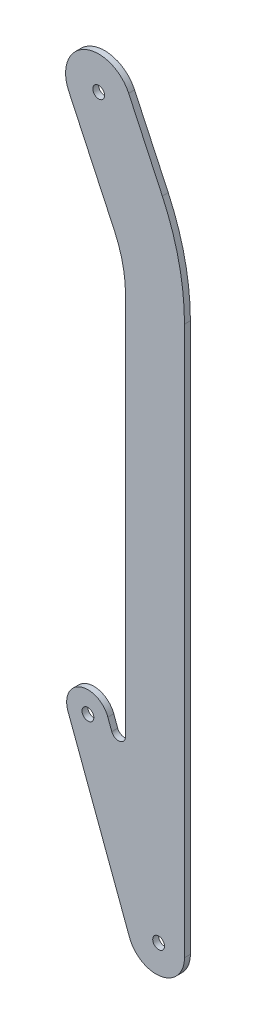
ISO-10303-21;
HEADER;
FILE_DESCRIPTION(('STEP AP214'),'2;1');
FILE_NAME('part.step','',(''),(''),'','','');
FILE_SCHEMA(('AUTOMOTIVE_DESIGN { 1 0 10303 214 1 1 1 1 }'));
ENDSEC;
DATA;
#1=APPLICATION_CONTEXT('core data for automotive mechanical design processes');
#2=APPLICATION_PROTOCOL_DEFINITION('international standard','automotive_design',2000,#1);
#3=PRODUCT_CONTEXT('',#1,'mechanical');
#4=PRODUCT('Part','Part','',(#3));
#5=PRODUCT_RELATED_PRODUCT_CATEGORY('part','',(#4));
#6=PRODUCT_DEFINITION_FORMATION('','',#4);
#7=PRODUCT_DEFINITION_CONTEXT('part definition',#1,'design');
#8=PRODUCT_DEFINITION('design','',#6,#7);
#9=PRODUCT_DEFINITION_SHAPE('','',#8);
#10=(LENGTH_UNIT() NAMED_UNIT(*) SI_UNIT(.MILLI.,.METRE.));
#11=(NAMED_UNIT(*) PLANE_ANGLE_UNIT() SI_UNIT($,.RADIAN.));
#12=(NAMED_UNIT(*) SI_UNIT($,.STERADIAN.) SOLID_ANGLE_UNIT());
#13=UNCERTAINTY_MEASURE_WITH_UNIT(LENGTH_MEASURE(1.E-05),#10,'distance_accuracy_value','');
#14=(GEOMETRIC_REPRESENTATION_CONTEXT(3) GLOBAL_UNCERTAINTY_ASSIGNED_CONTEXT((#13)) GLOBAL_UNIT_ASSIGNED_CONTEXT((#10,
#11,#12)) REPRESENTATION_CONTEXT('',''));
#15=CARTESIAN_POINT('',(0.,0.,0.));
#16=DIRECTION('',(0.,0.,1.));
#17=DIRECTION('',(1.,0.,0.));
#18=AXIS2_PLACEMENT_3D('',#15,#16,#17);
#19=CARTESIAN_POINT('',(-25.3570957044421,298.926441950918,-2.5));
#20=DIRECTION('',(0.,0.,1.));
#21=DIRECTION('',(1.,0.,0.));
#22=AXIS2_PLACEMENT_3D('',#19,#20,#21);
#23=CYLINDRICAL_SURFACE('',#22,14.);
#24=CARTESIAN_POINT('',(-25.3570957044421,298.926441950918,0.));
#25=DIRECTION('',(0.,0.,1.));
#26=DIRECTION('',(1.,0.,0.));
#27=AXIS2_PLACEMENT_3D('',#24,#25,#26);
#28=CIRCLE('',#27,14.);
#29=CARTESIAN_POINT('',(-12.668786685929,304.843097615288,0.));
#30=VERTEX_POINT('',#29);
#31=CARTESIAN_POINT('',(-38.0454047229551,293.009786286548,0.));
#32=VERTEX_POINT('',#31);
#33=EDGE_CURVE('E158',#30,#32,#28,.T.);
#34=ORIENTED_EDGE('',*,*,#33,.F.);
#35=DIRECTION('',(0.,0.,1.));
#36=VECTOR('',#35,1.);
#37=CARTESIAN_POINT('',(-12.668786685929,304.843097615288,-2.5));
#38=LINE('',#37,#36);
#39=CARTESIAN_POINT('',(-12.668786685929,304.843097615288,-2.5));
#40=VERTEX_POINT('',#39);
#41=EDGE_CURVE('E11',#40,#30,#38,.T.);
#42=ORIENTED_EDGE('',*,*,#41,.F.);
#43=CARTESIAN_POINT('',(-25.3570957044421,298.926441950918,-2.5));
#44=DIRECTION('',(0.,0.,1.));
#45=DIRECTION('',(1.,0.,0.));
#46=AXIS2_PLACEMENT_3D('',#43,#44,#45);
#47=CIRCLE('',#46,14.);
#48=CARTESIAN_POINT('',(-38.0454047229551,293.009786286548,-2.5));
#49=VERTEX_POINT('',#48);
#50=EDGE_CURVE('E191',#40,#49,#47,.T.);
#51=ORIENTED_EDGE('',*,*,#50,.T.);
#52=DIRECTION('',(0.,0.,1.));
#53=VECTOR('',#52,1.);
#54=CARTESIAN_POINT('',(-38.0454047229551,293.009786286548,-2.5));
#55=LINE('',#54,#53);
#56=EDGE_CURVE('E40',#49,#32,#55,.T.);
#57=ORIENTED_EDGE('',*,*,#56,.T.);
#58=EDGE_LOOP('',(#34,#42,#51,#57));
#59=FACE_BOUND('',#58,.T.);
#60=ADVANCED_FACE('F37',(#59),#23,.T.);
#61=CARTESIAN_POINT('',(-12.668786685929,304.843097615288,-2.5));
#62=DIRECTION('',(0.90630778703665,0.4226182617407,0.));
#63=DIRECTION('',(-0.4226182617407,0.90630778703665,0.));
#64=AXIS2_PLACEMENT_3D('',#61,#62,#63);
#65=PLANE('',#64);
#66=DIRECTION('',(-0.4226182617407,0.90630778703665,0.));
#67=VECTOR('',#66,1.);
#68=CARTESIAN_POINT('',(-12.668786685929,304.843097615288,0.));
#69=LINE('',#68,#67);
#70=CARTESIAN_POINT('',(1.56356733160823,274.321715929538,0.));
#71=VERTEX_POINT('',#70);
#72=EDGE_CURVE('E189',#71,#30,#69,.T.);
#73=ORIENTED_EDGE('',*,*,#72,.F.);
#74=DIRECTION('',(0.,0.,1.));
#75=VECTOR('',#74,1.);
#76=CARTESIAN_POINT('',(1.56356733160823,274.321715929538,-2.5));
#77=LINE('',#76,#75);
#78=CARTESIAN_POINT('',(1.56356733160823,274.321715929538,-2.5));
#79=VERTEX_POINT('',#78);
#80=EDGE_CURVE('E46',#79,#71,#77,.T.);
#81=ORIENTED_EDGE('',*,*,#80,.F.);
#82=DIRECTION('',(-0.4226182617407,0.90630778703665,0.));
#83=VECTOR('',#82,1.);
#84=CARTESIAN_POINT('',(-12.668786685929,304.843097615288,-2.5));
#85=LINE('',#84,#83);
#86=EDGE_CURVE('E148',#79,#40,#85,.T.);
#87=ORIENTED_EDGE('',*,*,#86,.T.);
#88=ORIENTED_EDGE('',*,*,#41,.T.);
#89=EDGE_LOOP('',(#73,#81,#87,#88));
#90=FACE_BOUND('',#89,.T.);
#91=ADVANCED_FACE('F211',(#90),#65,.T.);
#92=CARTESIAN_POINT('',(-89.0672113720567,232.059889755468,-2.5));
#93=DIRECTION('',(0.,0.,1.));
#94=DIRECTION('',(1.,0.,0.));
#95=AXIS2_PLACEMENT_3D('',#92,#93,#94);
#96=CYLINDRICAL_SURFACE('',#95,100.);
#97=CARTESIAN_POINT('',(-89.0672113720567,232.059889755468,0.));
#98=DIRECTION('',(0.,0.,1.));
#99=DIRECTION('',(1.,0.,0.));
#100=AXIS2_PLACEMENT_3D('',#97,#98,#99);
#101=CIRCLE('',#100,100.);
#102=CARTESIAN_POINT('',(10.9327886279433,232.059889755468,0.));
#103=VERTEX_POINT('',#102);
#104=EDGE_CURVE('E135',#103,#71,#101,.T.);
#105=ORIENTED_EDGE('',*,*,#104,.F.);
#106=DIRECTION('',(0.,0.,1.));
#107=VECTOR('',#106,1.);
#108=CARTESIAN_POINT('',(10.9327886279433,232.059889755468,-2.5));
#109=LINE('',#108,#107);
#110=CARTESIAN_POINT('',(10.9327886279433,232.059889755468,-2.5));
#111=VERTEX_POINT('',#110);
#112=EDGE_CURVE('E130',#111,#103,#109,.T.);
#113=ORIENTED_EDGE('',*,*,#112,.F.);
#114=CARTESIAN_POINT('',(-89.0672113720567,232.059889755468,-2.5));
#115=DIRECTION('',(0.,0.,1.));
#116=DIRECTION('',(1.,0.,0.));
#117=AXIS2_PLACEMENT_3D('',#114,#115,#116);
#118=CIRCLE('',#117,100.);
#119=EDGE_CURVE('E133',#111,#79,#118,.T.);
#120=ORIENTED_EDGE('',*,*,#119,.T.);
#121=ORIENTED_EDGE('',*,*,#80,.T.);
#122=EDGE_LOOP('',(#105,#113,#120,#121));
#123=FACE_BOUND('',#122,.T.);
#124=ADVANCED_FACE('F132',(#123),#96,.T.);
#125=CARTESIAN_POINT('',(10.9327886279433,0.,-2.5));
#126=DIRECTION('',(1.,0.,0.));
#127=DIRECTION('',(0.,1.,0.));
#128=AXIS2_PLACEMENT_3D('',#125,#126,#127);
#129=PLANE('',#128);
#130=DIRECTION('',(0.,1.,0.));
#131=VECTOR('',#130,1.);
#132=CARTESIAN_POINT('',(10.9327886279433,0.,0.));
#133=LINE('',#132,#131);
#134=CARTESIAN_POINT('',(10.9327886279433,0.,0.));
#135=VERTEX_POINT('',#134);
#136=EDGE_CURVE('E186',#135,#103,#133,.T.);
#137=ORIENTED_EDGE('',*,*,#136,.F.);
#138=DIRECTION('',(0.,0.,1.));
#139=VECTOR('',#138,1.);
#140=CARTESIAN_POINT('',(10.9327886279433,0.,-2.5));
#141=LINE('',#140,#139);
#142=CARTESIAN_POINT('',(10.9327886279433,0.,-2.5));
#143=VERTEX_POINT('',#142);
#144=EDGE_CURVE('E140',#143,#135,#141,.T.);
#145=ORIENTED_EDGE('',*,*,#144,.F.);
#146=DIRECTION('',(0.,1.,0.));
#147=VECTOR('',#146,1.);
#148=CARTESIAN_POINT('',(10.9327886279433,0.,-2.5));
#149=LINE('',#148,#147);
#150=EDGE_CURVE('E146',#143,#111,#149,.T.);
#151=ORIENTED_EDGE('',*,*,#150,.T.);
#152=ORIENTED_EDGE('',*,*,#112,.T.);
#153=EDGE_LOOP('',(#137,#145,#151,#152));
#154=FACE_BOUND('',#153,.T.);
#155=ADVANCED_FACE('F150',(#154),#129,.T.);
#156=CARTESIAN_POINT('',(-1.06721137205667,0.,-2.5));
#157=DIRECTION('',(0.,0.,1.));
#158=DIRECTION('',(1.,0.,0.));
#159=AXIS2_PLACEMENT_3D('',#156,#157,#158);
#160=CYLINDRICAL_SURFACE('',#159,12.);
#161=CARTESIAN_POINT('',(-1.06721137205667,0.,0.));
#162=DIRECTION('',(0.,0.,1.));
#163=DIRECTION('',(1.,0.,0.));
#164=AXIS2_PLACEMENT_3D('',#161,#162,#163);
#165=CIRCLE('',#164,12.);
#166=CARTESIAN_POINT('',(-12.3114693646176,-4.19126021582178,0.));
#167=VERTEX_POINT('',#166);
#168=EDGE_CURVE('E183',#167,#135,#165,.T.);
#169=ORIENTED_EDGE('',*,*,#168,.F.);
#170=DIRECTION('',(0.,0.,1.));
#171=VECTOR('',#170,1.);
#172=CARTESIAN_POINT('',(-12.3114693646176,-4.19126021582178,-2.5));
#173=LINE('',#172,#171);
#174=CARTESIAN_POINT('',(-12.3114693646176,-4.19126021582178,-2.5));
#175=VERTEX_POINT('',#174);
#176=EDGE_CURVE('E195',#175,#167,#173,.T.);
#177=ORIENTED_EDGE('',*,*,#176,.F.);
#178=CARTESIAN_POINT('',(-1.06721137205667,0.,-2.5));
#179=DIRECTION('',(0.,0.,1.));
#180=DIRECTION('',(1.,0.,0.));
#181=AXIS2_PLACEMENT_3D('',#178,#179,#180);
#182=CIRCLE('',#181,12.);
#183=EDGE_CURVE('E151',#175,#143,#182,.T.);
#184=ORIENTED_EDGE('',*,*,#183,.T.);
#185=ORIENTED_EDGE('',*,*,#144,.T.);
#186=EDGE_LOOP('',(#169,#177,#184,#185));
#187=FACE_BOUND('',#186,.T.);
#188=ADVANCED_FACE('F224',(#187),#160,.T.);
#189=CARTESIAN_POINT('',(-38.3393736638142,65.6360604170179,-2.5));
#190=DIRECTION('',(-0.937021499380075,-0.349271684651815,0.));
#191=DIRECTION('',(0.349271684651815,-0.937021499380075,0.));
#192=AXIS2_PLACEMENT_3D('',#189,#190,#191);
#193=PLANE('',#192);
#194=DIRECTION('',(0.349271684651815,-0.937021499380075,0.));
#195=VECTOR('',#194,1.);
#196=CARTESIAN_POINT('',(-38.3393736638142,65.6360604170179,0.));
#197=LINE('',#196,#195);
#198=CARTESIAN_POINT('',(-38.3393736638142,65.6360604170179,0.));
#199=VERTEX_POINT('',#198);
#200=EDGE_CURVE('E180',#199,#167,#197,.T.);
#201=ORIENTED_EDGE('',*,*,#200,.F.);
#202=DIRECTION('',(0.,0.,1.));
#203=VECTOR('',#202,1.);
#204=CARTESIAN_POINT('',(-38.3393736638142,65.6360604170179,-2.5));
#205=LINE('',#204,#203);
#206=CARTESIAN_POINT('',(-38.3393736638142,65.6360604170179,-2.5));
#207=VERTEX_POINT('',#206);
#208=EDGE_CURVE('E197',#207,#199,#205,.T.);
#209=ORIENTED_EDGE('',*,*,#208,.F.);
#210=DIRECTION('',(0.349271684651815,-0.937021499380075,0.));
#211=VECTOR('',#210,1.);
#212=CARTESIAN_POINT('',(-38.3393736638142,65.6360604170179,-2.5));
#213=LINE('',#212,#211);
#214=EDGE_CURVE('E153',#207,#175,#213,.T.);
#215=ORIENTED_EDGE('',*,*,#214,.T.);
#216=ORIENTED_EDGE('',*,*,#176,.T.);
#217=EDGE_LOOP('',(#201,#209,#215,#216));
#218=FACE_BOUND('',#217,.T.);
#219=ADVANCED_FACE('F227',(#218),#193,.T.);
#220=CARTESIAN_POINT('',(-29.9061801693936,68.7795055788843,-2.5));
#221=DIRECTION('',(0.,0.,1.));
#222=DIRECTION('',(1.,0.,0.));
#223=AXIS2_PLACEMENT_3D('',#220,#221,#222);
#224=CYLINDRICAL_SURFACE('',#223,9.);
#225=CARTESIAN_POINT('',(-29.9061801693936,68.7795055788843,0.));
#226=DIRECTION('',(0.,0.,1.));
#227=DIRECTION('',(1.,0.,0.));
#228=AXIS2_PLACEMENT_3D('',#225,#226,#227);
#229=CIRCLE('',#228,9.);
#230=CARTESIAN_POINT('',(-21.4729866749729,71.9229507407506,0.));
#231=VERTEX_POINT('',#230);
#232=EDGE_CURVE('E177',#231,#199,#229,.T.);
#233=ORIENTED_EDGE('',*,*,#232,.F.);
#234=DIRECTION('',(0.,0.,1.));
#235=VECTOR('',#234,1.);
#236=CARTESIAN_POINT('',(-21.4729866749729,71.9229507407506,-2.5));
#237=LINE('',#236,#235);
#238=CARTESIAN_POINT('',(-21.4729866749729,71.9229507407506,-2.5));
#239=VERTEX_POINT('',#238);
#240=EDGE_CURVE('E199',#239,#231,#237,.T.);
#241=ORIENTED_EDGE('',*,*,#240,.F.);
#242=CARTESIAN_POINT('',(-29.9061801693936,68.7795055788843,-2.5));
#243=DIRECTION('',(0.,0.,1.));
#244=DIRECTION('',(1.,0.,0.));
#245=AXIS2_PLACEMENT_3D('',#242,#243,#244);
#246=CIRCLE('',#245,9.);
#247=EDGE_CURVE('E311',#239,#207,#246,.T.);
#248=ORIENTED_EDGE('',*,*,#247,.T.);
#249=ORIENTED_EDGE('',*,*,#208,.T.);
#250=EDGE_LOOP('',(#233,#241,#248,#249));
#251=FACE_BOUND('',#250,.T.);
#252=ADVANCED_FACE('F231',(#251),#224,.T.);
#253=CARTESIAN_POINT('',(-21.4729866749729,71.9229507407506,-2.5));
#254=DIRECTION('',(0.937021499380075,0.349271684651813,0.));
#255=DIRECTION('',(-0.349271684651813,0.937021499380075,0.));
#256=AXIS2_PLACEMENT_3D('',#253,#254,#255);
#257=PLANE('',#256);
#258=DIRECTION('',(-0.349271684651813,0.937021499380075,0.));
#259=VECTOR('',#258,1.);
#260=CARTESIAN_POINT('',(-21.4729866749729,71.9229507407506,0.));
#261=LINE('',#260,#259);
#262=CARTESIAN_POINT('',(-19.8110644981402,67.4643676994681,0.));
#263=VERTEX_POINT('',#262);
#264=EDGE_CURVE('E174',#263,#231,#261,.T.);
#265=ORIENTED_EDGE('',*,*,#264,.F.);
#266=DIRECTION('',(0.,0.,1.));
#267=VECTOR('',#266,1.);
#268=CARTESIAN_POINT('',(-19.8110644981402,67.4643676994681,-2.5));
#269=LINE('',#268,#267);
#270=CARTESIAN_POINT('',(-19.8110644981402,67.4643676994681,-2.5));
#271=VERTEX_POINT('',#270);
#272=EDGE_CURVE('E201',#271,#263,#269,.T.);
#273=ORIENTED_EDGE('',*,*,#272,.F.);
#274=DIRECTION('',(-0.349271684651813,0.937021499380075,0.));
#275=VECTOR('',#274,1.);
#276=CARTESIAN_POINT('',(-21.4729866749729,71.9229507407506,-2.5));
#277=LINE('',#276,#275);
#278=EDGE_CURVE('E308',#271,#239,#277,.T.);
#279=ORIENTED_EDGE('',*,*,#278,.T.);
#280=ORIENTED_EDGE('',*,*,#240,.T.);
#281=EDGE_LOOP('',(#265,#273,#279,#280));
#282=FACE_BOUND('',#281,.T.);
#283=ADVANCED_FACE('F235',(#282),#257,.T.);
#284=CARTESIAN_POINT('',(-17.,68.5121827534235,-2.5));
#285=DIRECTION('',(0.,0.,1.));
#286=DIRECTION('',(1.,0.,0.));
#287=AXIS2_PLACEMENT_3D('',#284,#285,#286);
#288=CYLINDRICAL_SURFACE('',#287,3.);
#289=CARTESIAN_POINT('',(-17.,68.5121827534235,0.));
#290=DIRECTION('',(0.,0.,-1.));
#291=DIRECTION('',(1.,0.,0.));
#292=AXIS2_PLACEMENT_3D('',#289,#290,#291);
#293=CIRCLE('',#292,3.);
#294=CARTESIAN_POINT('',(-14.,68.5121827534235,0.));
#295=VERTEX_POINT('',#294);
#296=EDGE_CURVE('E171',#295,#263,#293,.T.);
#297=ORIENTED_EDGE('',*,*,#296,.F.);
#298=DIRECTION('',(0.,0.,1.));
#299=VECTOR('',#298,1.);
#300=CARTESIAN_POINT('',(-14.,68.5121827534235,-2.5));
#301=LINE('',#300,#299);
#302=CARTESIAN_POINT('',(-14.,68.5121827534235,-2.5));
#303=VERTEX_POINT('',#302);
#304=EDGE_CURVE('E203',#303,#295,#301,.T.);
#305=ORIENTED_EDGE('',*,*,#304,.F.);
#306=CARTESIAN_POINT('',(-17.,68.5121827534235,-2.5));
#307=DIRECTION('',(0.,0.,-1.));
#308=DIRECTION('',(1.,0.,0.));
#309=AXIS2_PLACEMENT_3D('',#306,#307,#308);
#310=CIRCLE('',#309,3.);
#311=EDGE_CURVE('E305',#303,#271,#310,.T.);
#312=ORIENTED_EDGE('',*,*,#311,.T.);
#313=ORIENTED_EDGE('',*,*,#272,.T.);
#314=EDGE_LOOP('',(#297,#305,#312,#313));
#315=FACE_BOUND('',#314,.T.);
#316=ADVANCED_FACE('F239',(#315),#288,.F.);
#317=CARTESIAN_POINT('',(-14.,230.359516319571,-2.5));
#318=DIRECTION('',(-1.,0.,0.));
#319=DIRECTION('',(0.,-1.,0.));
#320=AXIS2_PLACEMENT_3D('',#317,#318,#319);
#321=PLANE('',#320);
#322=DIRECTION('',(0.,-1.,0.));
#323=VECTOR('',#322,1.);
#324=CARTESIAN_POINT('',(-14.,230.359516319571,0.));
#325=LINE('',#324,#323);
#326=CARTESIAN_POINT('',(-14.,230.359516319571,0.));
#327=VERTEX_POINT('',#326);
#328=EDGE_CURVE('E168',#327,#295,#325,.T.);
#329=ORIENTED_EDGE('',*,*,#328,.F.);
#330=DIRECTION('',(0.,0.,1.));
#331=VECTOR('',#330,1.);
#332=CARTESIAN_POINT('',(-14.,230.359516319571,-2.5));
#333=LINE('',#332,#331);
#334=CARTESIAN_POINT('',(-14.,230.359516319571,-2.5));
#335=VERTEX_POINT('',#334);
#336=EDGE_CURVE('E205',#335,#327,#333,.T.);
#337=ORIENTED_EDGE('',*,*,#336,.F.);
#338=DIRECTION('',(0.,-1.,0.));
#339=VECTOR('',#338,1.);
#340=CARTESIAN_POINT('',(-14.,230.359516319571,-2.5));
#341=LINE('',#340,#339);
#342=EDGE_CURVE('E302',#335,#303,#341,.T.);
#343=ORIENTED_EDGE('',*,*,#342,.T.);
#344=ORIENTED_EDGE('',*,*,#304,.T.);
#345=EDGE_LOOP('',(#329,#337,#343,#344));
#346=FACE_BOUND('',#345,.T.);
#347=ADVANCED_FACE('F243',(#346),#321,.T.);
#348=CARTESIAN_POINT('',(-64.,230.359516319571,-2.5));
#349=DIRECTION('',(0.,0.,1.));
#350=DIRECTION('',(1.,0.,0.));
#351=AXIS2_PLACEMENT_3D('',#348,#349,#350);
#352=CYLINDRICAL_SURFACE('',#351,50.);
#353=CARTESIAN_POINT('',(-64.,230.359516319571,0.));
#354=DIRECTION('',(0.,0.,-1.));
#355=DIRECTION('',(1.,0.,0.));
#356=AXIS2_PLACEMENT_3D('',#353,#354,#355);
#357=CIRCLE('',#356,50.);
#358=CARTESIAN_POINT('',(-18.6846106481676,251.490429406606,0.));
#359=VERTEX_POINT('',#358);
#360=EDGE_CURVE('E165',#359,#327,#357,.T.);
#361=ORIENTED_EDGE('',*,*,#360,.F.);
#362=DIRECTION('',(0.,0.,1.));
#363=VECTOR('',#362,1.);
#364=CARTESIAN_POINT('',(-18.6846106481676,251.490429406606,-2.5));
#365=LINE('',#364,#363);
#366=CARTESIAN_POINT('',(-18.6846106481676,251.490429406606,-2.5));
#367=VERTEX_POINT('',#366);
#368=EDGE_CURVE('E206',#367,#359,#365,.T.);
#369=ORIENTED_EDGE('',*,*,#368,.F.);
#370=CARTESIAN_POINT('',(-64.,230.359516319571,-2.5));
#371=DIRECTION('',(0.,0.,-1.));
#372=DIRECTION('',(1.,0.,0.));
#373=AXIS2_PLACEMENT_3D('',#370,#371,#372);
#374=CIRCLE('',#373,50.);
#375=EDGE_CURVE('E299',#367,#335,#374,.T.);
#376=ORIENTED_EDGE('',*,*,#375,.T.);
#377=ORIENTED_EDGE('',*,*,#336,.T.);
#378=EDGE_LOOP('',(#361,#369,#376,#377));
#379=FACE_BOUND('',#378,.T.);
#380=ADVANCED_FACE('F247',(#379),#352,.F.);
#381=CARTESIAN_POINT('',(-38.0454047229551,293.009786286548,-2.5));
#382=DIRECTION('',(-0.906307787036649,-0.422618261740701,0.));
#383=DIRECTION('',(0.422618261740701,-0.906307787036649,0.));
#384=AXIS2_PLACEMENT_3D('',#381,#382,#383);
#385=PLANE('',#384);
#386=DIRECTION('',(0.422618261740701,-0.906307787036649,0.));
#387=VECTOR('',#386,1.);
#388=CARTESIAN_POINT('',(-38.0454047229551,293.009786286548,0.));
#389=LINE('',#388,#387);
#390=EDGE_CURVE('E161',#32,#359,#389,.T.);
#391=ORIENTED_EDGE('',*,*,#390,.F.);
#392=ORIENTED_EDGE('',*,*,#56,.F.);
#393=DIRECTION('',(0.422618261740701,-0.906307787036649,0.));
#394=VECTOR('',#393,1.);
#395=CARTESIAN_POINT('',(-38.0454047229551,293.009786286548,-2.5));
#396=LINE('',#395,#394);
#397=EDGE_CURVE('E297',#49,#367,#396,.T.);
#398=ORIENTED_EDGE('',*,*,#397,.T.);
#399=ORIENTED_EDGE('',*,*,#368,.T.);
#400=EDGE_LOOP('',(#391,#392,#398,#399));
#401=FACE_BOUND('',#400,.T.);
#402=ADVANCED_FACE('F208',(#401),#385,.T.);
#403=CARTESIAN_POINT('',(-25.3570957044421,298.926441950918,-2.5));
#404=DIRECTION('',(0.,0.,1.));
#405=DIRECTION('',(1.,0.,0.));
#406=AXIS2_PLACEMENT_3D('',#403,#404,#405);
#407=PLANE('',#406);
#408=CARTESIAN_POINT('',(-25.3570957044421,298.926441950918,-2.5));
#409=DIRECTION('',(0.,0.,1.));
#410=DIRECTION('',(1.,0.,0.));
#411=AXIS2_PLACEMENT_3D('',#408,#409,#410);
#412=CIRCLE('',#411,2.5);
#413=CARTESIAN_POINT('',(-22.8570957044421,298.926441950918,-2.5));
#414=VERTEX_POINT('',#413);
#415=EDGE_CURVE('E278',#414,#414,#412,.T.);
#416=ORIENTED_EDGE('',*,*,#415,.T.);
#417=EDGE_LOOP('',(#416));
#418=FACE_BOUND('',#417,.T.);
#419=CARTESIAN_POINT('',(-29.9061801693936,68.7795055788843,-2.5));
#420=DIRECTION('',(0.,0.,1.));
#421=DIRECTION('',(1.,0.,0.));
#422=AXIS2_PLACEMENT_3D('',#419,#420,#421);
#423=CIRCLE('',#422,2.5);
#424=CARTESIAN_POINT('',(-27.4061801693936,68.7795055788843,-2.5));
#425=VERTEX_POINT('',#424);
#426=EDGE_CURVE('E286',#425,#425,#423,.T.);
#427=ORIENTED_EDGE('',*,*,#426,.T.);
#428=EDGE_LOOP('',(#427));
#429=FACE_BOUND('',#428,.T.);
#430=CARTESIAN_POINT('',(0.,0.,-2.5));
#431=DIRECTION('',(0.,0.,1.));
#432=DIRECTION('',(1.,0.,0.));
#433=AXIS2_PLACEMENT_3D('',#430,#431,#432);
#434=CIRCLE('',#433,2.5);
#435=CARTESIAN_POINT('',(2.5,0.,-2.5));
#436=VERTEX_POINT('',#435);
#437=EDGE_CURVE('E162',#436,#436,#434,.T.);
#438=ORIENTED_EDGE('',*,*,#437,.T.);
#439=EDGE_LOOP('',(#438));
#440=FACE_BOUND('',#439,.T.);
#441=ORIENTED_EDGE('',*,*,#50,.F.);
#442=ORIENTED_EDGE('',*,*,#86,.F.);
#443=ORIENTED_EDGE('',*,*,#119,.F.);
#444=ORIENTED_EDGE('',*,*,#150,.F.);
#445=ORIENTED_EDGE('',*,*,#183,.F.);
#446=ORIENTED_EDGE('',*,*,#214,.F.);
#447=ORIENTED_EDGE('',*,*,#247,.F.);
#448=ORIENTED_EDGE('',*,*,#278,.F.);
#449=ORIENTED_EDGE('',*,*,#311,.F.);
#450=ORIENTED_EDGE('',*,*,#342,.F.);
#451=ORIENTED_EDGE('',*,*,#375,.F.);
#452=ORIENTED_EDGE('',*,*,#397,.F.);
#453=EDGE_LOOP('',(#441,#442,#443,#444,#445,#446,#447,#448,#449,#450,#451,#452));
#454=FACE_BOUND('',#453,.T.);
#455=ADVANCED_FACE('F144',(#418,#429,#440,#454),#407,.F.);
#456=CARTESIAN_POINT('',(-25.3570957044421,298.926441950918,0.));
#457=DIRECTION('',(0.,0.,1.));
#458=DIRECTION('',(1.,0.,0.));
#459=AXIS2_PLACEMENT_3D('',#456,#457,#458);
#460=PLANE('',#459);
#461=CARTESIAN_POINT('',(-25.3570957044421,298.926441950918,0.));
#462=DIRECTION('',(0.,0.,1.));
#463=DIRECTION('',(1.,0.,0.));
#464=AXIS2_PLACEMENT_3D('',#461,#462,#463);
#465=CIRCLE('',#464,2.5);
#466=CARTESIAN_POINT('',(-22.8570957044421,298.926441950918,0.));
#467=VERTEX_POINT('',#466);
#468=EDGE_CURVE('E281',#467,#467,#465,.T.);
#469=ORIENTED_EDGE('',*,*,#468,.F.);
#470=EDGE_LOOP('',(#469));
#471=FACE_BOUND('',#470,.T.);
#472=CARTESIAN_POINT('',(-29.9061801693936,68.7795055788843,0.));
#473=DIRECTION('',(0.,0.,1.));
#474=DIRECTION('',(1.,0.,0.));
#475=AXIS2_PLACEMENT_3D('',#472,#473,#474);
#476=CIRCLE('',#475,2.5);
#477=CARTESIAN_POINT('',(-27.4061801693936,68.7795055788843,0.));
#478=VERTEX_POINT('',#477);
#479=EDGE_CURVE('E283',#478,#478,#476,.T.);
#480=ORIENTED_EDGE('',*,*,#479,.F.);
#481=EDGE_LOOP('',(#480));
#482=FACE_BOUND('',#481,.T.);
#483=CARTESIAN_POINT('',(0.,0.,0.));
#484=DIRECTION('',(0.,0.,1.));
#485=DIRECTION('',(1.,0.,0.));
#486=AXIS2_PLACEMENT_3D('',#483,#484,#485);
#487=CIRCLE('',#486,2.5);
#488=CARTESIAN_POINT('',(2.5,0.,0.));
#489=VERTEX_POINT('',#488);
#490=EDGE_CURVE('E289',#489,#489,#487,.T.);
#491=ORIENTED_EDGE('',*,*,#490,.F.);
#492=EDGE_LOOP('',(#491));
#493=FACE_BOUND('',#492,.T.);
#494=ORIENTED_EDGE('',*,*,#33,.T.);
#495=ORIENTED_EDGE('',*,*,#390,.T.);
#496=ORIENTED_EDGE('',*,*,#360,.T.);
#497=ORIENTED_EDGE('',*,*,#328,.T.);
#498=ORIENTED_EDGE('',*,*,#296,.T.);
#499=ORIENTED_EDGE('',*,*,#264,.T.);
#500=ORIENTED_EDGE('',*,*,#232,.T.);
#501=ORIENTED_EDGE('',*,*,#200,.T.);
#502=ORIENTED_EDGE('',*,*,#168,.T.);
#503=ORIENTED_EDGE('',*,*,#136,.T.);
#504=ORIENTED_EDGE('',*,*,#104,.T.);
#505=ORIENTED_EDGE('',*,*,#72,.T.);
#506=EDGE_LOOP('',(#494,#495,#496,#497,#498,#499,#500,#501,#502,#503,#504,#505));
#507=FACE_BOUND('',#506,.T.);
#508=ADVANCED_FACE('F210',(#471,#482,#493,#507),#460,.T.);
#509=CARTESIAN_POINT('',(0.,0.,-2.5));
#510=DIRECTION('',(0.,0.,1.));
#511=DIRECTION('',(1.,0.,0.));
#512=AXIS2_PLACEMENT_3D('',#509,#510,#511);
#513=CYLINDRICAL_SURFACE('',#512,2.5);
#514=ORIENTED_EDGE('',*,*,#437,.F.);
#515=EDGE_LOOP('',(#514));
#516=FACE_BOUND('',#515,.T.);
#517=ORIENTED_EDGE('',*,*,#490,.T.);
#518=EDGE_LOOP('',(#517));
#519=FACE_BOUND('',#518,.T.);
#520=ADVANCED_FACE('F259',(#516,#519),#513,.F.);
#521=CARTESIAN_POINT('',(-29.9061801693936,68.7795055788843,-2.5));
#522=DIRECTION('',(0.,0.,1.));
#523=DIRECTION('',(1.,0.,0.));
#524=AXIS2_PLACEMENT_3D('',#521,#522,#523);
#525=CYLINDRICAL_SURFACE('',#524,2.5);
#526=ORIENTED_EDGE('',*,*,#426,.F.);
#527=EDGE_LOOP('',(#526));
#528=FACE_BOUND('',#527,.T.);
#529=ORIENTED_EDGE('',*,*,#479,.T.);
#530=EDGE_LOOP('',(#529));
#531=FACE_BOUND('',#530,.T.);
#532=ADVANCED_FACE('F266',(#528,#531),#525,.F.);
#533=CARTESIAN_POINT('',(-25.3570957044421,298.926441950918,-2.5));
#534=DIRECTION('',(0.,0.,1.));
#535=DIRECTION('',(1.,0.,0.));
#536=AXIS2_PLACEMENT_3D('',#533,#534,#535);
#537=CYLINDRICAL_SURFACE('',#536,2.5);
#538=ORIENTED_EDGE('',*,*,#415,.F.);
#539=EDGE_LOOP('',(#538));
#540=FACE_BOUND('',#539,.T.);
#541=ORIENTED_EDGE('',*,*,#468,.T.);
#542=EDGE_LOOP('',(#541));
#543=FACE_BOUND('',#542,.T.);
#544=ADVANCED_FACE('F270',(#540,#543),#537,.F.);
#545=CLOSED_SHELL('',(#60,#91,#124,#155,#188,#219,#252,#283,#316,#347,#380,#402,#455,#508,#520,
#532,#544));
#546=MANIFOLD_SOLID_BREP('B2',#545);
#547=ADVANCED_BREP_SHAPE_REPRESENTATION('',(#18,#546),#14);
#548=SHAPE_DEFINITION_REPRESENTATION(#9,#547);
ENDSEC;
END-ISO-10303-21;
